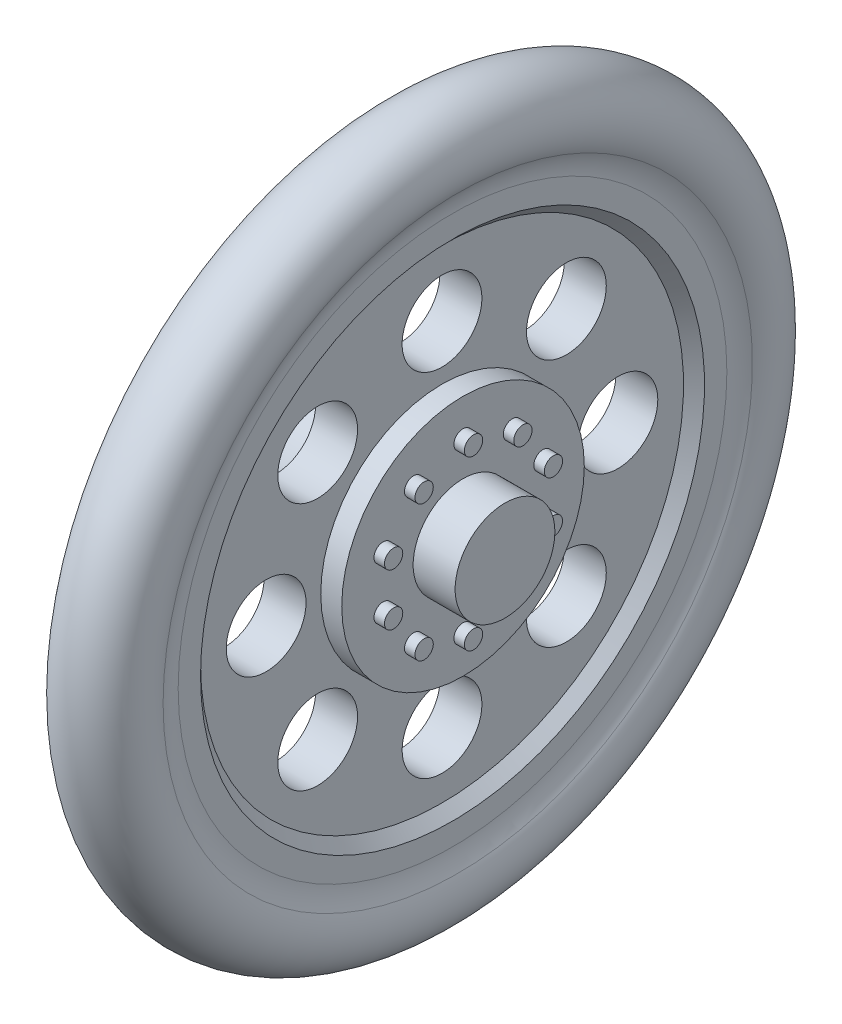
ISO-10303-21;
HEADER;
FILE_DESCRIPTION(('STEP AP214'),'2;1');
FILE_NAME('part.step','',(''),(''),'','','');
FILE_SCHEMA(('AUTOMOTIVE_DESIGN { 1 0 10303 214 1 1 1 1 }'));
ENDSEC;
DATA;
#1=APPLICATION_CONTEXT('core data for automotive mechanical design processes');
#2=APPLICATION_PROTOCOL_DEFINITION('international standard','automotive_design',2000,#1);
#3=PRODUCT_CONTEXT('',#1,'mechanical');
#4=PRODUCT('Part','Part','',(#3));
#5=PRODUCT_RELATED_PRODUCT_CATEGORY('part','',(#4));
#6=PRODUCT_DEFINITION_FORMATION('','',#4);
#7=PRODUCT_DEFINITION_CONTEXT('part definition',#1,'design');
#8=PRODUCT_DEFINITION('design','',#6,#7);
#9=PRODUCT_DEFINITION_SHAPE('','',#8);
#10=(LENGTH_UNIT() NAMED_UNIT(*) SI_UNIT(.MILLI.,.METRE.));
#11=(NAMED_UNIT(*) PLANE_ANGLE_UNIT() SI_UNIT($,.RADIAN.));
#12=(NAMED_UNIT(*) SI_UNIT($,.STERADIAN.) SOLID_ANGLE_UNIT());
#13=UNCERTAINTY_MEASURE_WITH_UNIT(LENGTH_MEASURE(1.E-05),#10,'distance_accuracy_value','');
#14=(GEOMETRIC_REPRESENTATION_CONTEXT(3) GLOBAL_UNCERTAINTY_ASSIGNED_CONTEXT((#13)) GLOBAL_UNIT_ASSIGNED_CONTEXT((#10,
#11,#12)) REPRESENTATION_CONTEXT('',''));
#15=CARTESIAN_POINT('',(0.,0.,0.));
#16=DIRECTION('',(0.,0.,1.));
#17=DIRECTION('',(1.,0.,0.));
#18=AXIS2_PLACEMENT_3D('',#15,#16,#17);
#19=CARTESIAN_POINT('',(10.5,0.,0.));
#20=DIRECTION('',(1.,0.,0.));
#21=DIRECTION('',(0.,0.,-1.));
#22=AXIS2_PLACEMENT_3D('',#19,#20,#21);
#23=PLANE('',#22);
#24=CARTESIAN_POINT('',(10.5,1.23606797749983,-3.8042260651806));
#25=DIRECTION('',(1.,0.,0.));
#26=DIRECTION('',(0.,-0.95105651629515,-0.309016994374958));
#27=AXIS2_PLACEMENT_3D('',#24,#25,#26);
#28=CIRCLE('',#27,0.435);
#29=CARTESIAN_POINT('',(10.5,0.822358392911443,-3.93864845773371));
#30=VERTEX_POINT('',#29);
#31=EDGE_CURVE('E102',#30,#30,#28,.T.);
#32=ORIENTED_EDGE('',*,*,#31,.F.);
#33=EDGE_LOOP('',(#32));
#34=FACE_BOUND('',#33,.T.);
#35=CARTESIAN_POINT('',(10.5,-3.23606797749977,-2.35114100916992));
#36=DIRECTION('',(1.,0.,0.));
#37=DIRECTION('',(0.,-0.58778525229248,0.809016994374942));
#38=AXIS2_PLACEMENT_3D('',#35,#36,#37);
#39=CIRCLE('',#38,0.435);
#40=CARTESIAN_POINT('',(10.5,-3.491754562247,-1.99921861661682));
#41=VERTEX_POINT('',#40);
#42=EDGE_CURVE('E114',#41,#41,#39,.T.);
#43=ORIENTED_EDGE('',*,*,#42,.F.);
#44=EDGE_LOOP('',(#43));
#45=FACE_BOUND('',#44,.T.);
#46=CARTESIAN_POINT('',(10.5,-3.2360679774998,2.35114100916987));
#47=DIRECTION('',(1.,0.,0.));
#48=DIRECTION('',(0.,0.587785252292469,0.809016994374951));
#49=AXIS2_PLACEMENT_3D('',#46,#47,#48);
#50=CIRCLE('',#49,0.435);
#51=CARTESIAN_POINT('',(10.5,-2.98038139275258,2.70306340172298));
#52=VERTEX_POINT('',#51);
#53=EDGE_CURVE('E126',#52,#52,#50,.T.);
#54=ORIENTED_EDGE('',*,*,#53,.F.);
#55=EDGE_LOOP('',(#54));
#56=FACE_BOUND('',#55,.T.);
#57=CARTESIAN_POINT('',(10.5,1.23606797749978,3.80422606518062));
#58=DIRECTION('',(1.,0.,0.));
#59=DIRECTION('',(0.,0.951056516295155,-0.309016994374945));
#60=AXIS2_PLACEMENT_3D('',#57,#58,#59);
#61=CIRCLE('',#60,0.435);
#62=CARTESIAN_POINT('',(10.5,1.64977756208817,3.66980367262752));
#63=VERTEX_POINT('',#62);
#64=EDGE_CURVE('E138',#63,#63,#61,.T.);
#65=ORIENTED_EDGE('',*,*,#64,.F.);
#66=EDGE_LOOP('',(#65));
#67=FACE_BOUND('',#66,.T.);
#68=CARTESIAN_POINT('',(10.5,4.,0.));
#69=DIRECTION('',(1.,0.,0.));
#70=DIRECTION('',(0.,0.,-1.));
#71=AXIS2_PLACEMENT_3D('',#68,#69,#70);
#72=CIRCLE('',#71,0.435);
#73=CARTESIAN_POINT('',(10.5,4.,-0.435));
#74=VERTEX_POINT('',#73);
#75=EDGE_CURVE('E150',#74,#74,#72,.T.);
#76=ORIENTED_EDGE('',*,*,#75,.F.);
#77=EDGE_LOOP('',(#76));
#78=FACE_BOUND('',#77,.T.);
#79=CARTESIAN_POINT('',(10.5,0.,0.));
#80=DIRECTION('',(1.,0.,0.));
#81=DIRECTION('',(0.,0.,-1.));
#82=AXIS2_PLACEMENT_3D('',#79,#80,#81);
#83=CIRCLE('',#82,5.775);
#84=CARTESIAN_POINT('',(10.5,0.,-5.775));
#85=VERTEX_POINT('',#84);
#86=EDGE_CURVE('E162',#85,#85,#83,.T.);
#87=ORIENTED_EDGE('',*,*,#86,.T.);
#88=EDGE_LOOP('',(#87));
#89=FACE_BOUND('',#88,.T.);
#90=CARTESIAN_POINT('',(10.5,0.,0.));
#91=DIRECTION('',(1.,0.,0.));
#92=DIRECTION('',(0.,0.,-1.));
#93=AXIS2_PLACEMENT_3D('',#90,#91,#92);
#94=CIRCLE('',#93,2.375);
#95=CARTESIAN_POINT('',(10.5,0.,-2.375));
#96=VERTEX_POINT('',#95);
#97=EDGE_CURVE('E156',#96,#96,#94,.T.);
#98=ORIENTED_EDGE('',*,*,#97,.F.);
#99=EDGE_LOOP('',(#98));
#100=FACE_BOUND('',#99,.T.);
#101=CARTESIAN_POINT('',(10.5,3.23606797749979,2.3511410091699));
#102=DIRECTION('',(1.,0.,0.));
#103=DIRECTION('',(0.,0.587785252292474,-0.809016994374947));
#104=AXIS2_PLACEMENT_3D('',#101,#102,#103);
#105=CIRCLE('',#104,0.435);
#106=CARTESIAN_POINT('',(10.5,3.49175456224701,1.9992186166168));
#107=VERTEX_POINT('',#106);
#108=EDGE_CURVE('E144',#107,#107,#105,.T.);
#109=ORIENTED_EDGE('',*,*,#108,.F.);
#110=EDGE_LOOP('',(#109));
#111=FACE_BOUND('',#110,.T.);
#112=CARTESIAN_POINT('',(10.5,-1.23606797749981,3.80422606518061));
#113=DIRECTION('',(1.,0.,0.));
#114=DIRECTION('',(0.,0.951056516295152,0.309016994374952));
#115=AXIS2_PLACEMENT_3D('',#112,#113,#114);
#116=CIRCLE('',#115,0.435);
#117=CARTESIAN_POINT('',(10.5,-0.822358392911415,3.93864845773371));
#118=VERTEX_POINT('',#117);
#119=EDGE_CURVE('E132',#118,#118,#116,.T.);
#120=ORIENTED_EDGE('',*,*,#119,.F.);
#121=EDGE_LOOP('',(#120));
#122=FACE_BOUND('',#121,.T.);
#123=CARTESIAN_POINT('',(10.5,-4.,0.));
#124=DIRECTION('',(1.,0.,0.));
#125=DIRECTION('',(0.,0.,1.));
#126=AXIS2_PLACEMENT_3D('',#123,#124,#125);
#127=CIRCLE('',#126,0.435);
#128=CARTESIAN_POINT('',(10.5,-4.,0.434999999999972));
#129=VERTEX_POINT('',#128);
#130=EDGE_CURVE('E120',#129,#129,#127,.T.);
#131=ORIENTED_EDGE('',*,*,#130,.F.);
#132=EDGE_LOOP('',(#131));
#133=FACE_BOUND('',#132,.T.);
#134=CARTESIAN_POINT('',(10.5,-1.23606797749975,-3.80422606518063));
#135=DIRECTION('',(1.,0.,0.));
#136=DIRECTION('',(0.,-0.951056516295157,0.309016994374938));
#137=AXIS2_PLACEMENT_3D('',#134,#135,#136);
#138=CIRCLE('',#137,0.435);
#139=CARTESIAN_POINT('',(10.5,-1.64977756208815,-3.66980367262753));
#140=VERTEX_POINT('',#139);
#141=EDGE_CURVE('E108',#140,#140,#138,.T.);
#142=ORIENTED_EDGE('',*,*,#141,.F.);
#143=EDGE_LOOP('',(#142));
#144=FACE_BOUND('',#143,.T.);
#145=CARTESIAN_POINT('',(10.5,3.23606797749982,-2.35114100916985));
#146=DIRECTION('',(1.,0.,0.));
#147=DIRECTION('',(0.,-0.587785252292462,-0.809016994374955));
#148=AXIS2_PLACEMENT_3D('',#145,#146,#147);
#149=CIRCLE('',#148,0.435);
#150=CARTESIAN_POINT('',(10.5,2.9803813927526,-2.70306340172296));
#151=VERTEX_POINT('',#150);
#152=EDGE_CURVE('E52',#151,#151,#149,.T.);
#153=ORIENTED_EDGE('',*,*,#152,.F.);
#154=EDGE_LOOP('',(#153));
#155=FACE_BOUND('',#154,.T.);
#156=ADVANCED_FACE('F32',(#34,#45,#56,#67,#78,#89,#100,#111,#122,#133,#144,#155),#23,.T.);
#157=CARTESIAN_POINT('',(9.5,11.5,0.));
#158=DIRECTION('',(-1.,0.,0.));
#159=DIRECTION('',(0.,0.,1.));
#160=AXIS2_PLACEMENT_3D('',#157,#158,#159);
#161=PLANE('',#160);
#162=CARTESIAN_POINT('',(9.5,5.92201929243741,-5.92201929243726));
#163=DIRECTION('',(1.,0.,0.));
#164=DIRECTION('',(0.,-0.707106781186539,-0.707106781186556));
#165=AXIS2_PLACEMENT_3D('',#162,#163,#164);
#166=CIRCLE('',#165,1.9);
#167=CARTESIAN_POINT('',(9.5,4.57851640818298,-7.26552217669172));
#168=VERTEX_POINT('',#167);
#169=EDGE_CURVE('E85',#168,#168,#166,.T.);
#170=ORIENTED_EDGE('',*,*,#169,.F.);
#171=EDGE_LOOP('',(#170));
#172=FACE_BOUND('',#171,.T.);
#173=CARTESIAN_POINT('',(9.5,0.,-8.375));
#174=DIRECTION('',(1.,0.,0.));
#175=DIRECTION('',(0.,-1.,0.));
#176=AXIS2_PLACEMENT_3D('',#173,#174,#175);
#177=CIRCLE('',#176,1.9);
#178=CARTESIAN_POINT('',(9.5,-1.89999999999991,-8.37500000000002));
#179=VERTEX_POINT('',#178);
#180=EDGE_CURVE('E75',#179,#179,#177,.T.);
#181=ORIENTED_EDGE('',*,*,#180,.F.);
#182=EDGE_LOOP('',(#181));
#183=FACE_BOUND('',#182,.T.);
#184=CARTESIAN_POINT('',(9.5,-5.92201929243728,-5.92201929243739));
#185=DIRECTION('',(1.,0.,0.));
#186=DIRECTION('',(0.,-0.707106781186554,0.707106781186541));
#187=AXIS2_PLACEMENT_3D('',#184,#185,#186);
#188=CIRCLE('',#187,1.9);
#189=CARTESIAN_POINT('',(9.5,-7.26552217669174,-4.57851640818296));
#190=VERTEX_POINT('',#189);
#191=EDGE_CURVE('E72',#190,#190,#188,.T.);
#192=ORIENTED_EDGE('',*,*,#191,.F.);
#193=EDGE_LOOP('',(#192));
#194=FACE_BOUND('',#193,.T.);
#195=CARTESIAN_POINT('',(9.5,-8.375,0.));
#196=DIRECTION('',(1.,0.,0.));
#197=DIRECTION('',(0.,0.,1.));
#198=AXIS2_PLACEMENT_3D('',#195,#196,#197);
#199=CIRCLE('',#198,1.9);
#200=CARTESIAN_POINT('',(9.5,-8.37500000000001,1.89999999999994));
#201=VERTEX_POINT('',#200);
#202=EDGE_CURVE('E69',#201,#201,#199,.T.);
#203=ORIENTED_EDGE('',*,*,#202,.F.);
#204=EDGE_LOOP('',(#203));
#205=FACE_BOUND('',#204,.T.);
#206=CARTESIAN_POINT('',(9.5,-5.92201929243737,5.92201929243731));
#207=DIRECTION('',(1.,0.,0.));
#208=DIRECTION('',(0.,0.707106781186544,0.707106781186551));
#209=AXIS2_PLACEMENT_3D('',#206,#207,#208);
#210=CIRCLE('',#209,1.9);
#211=CARTESIAN_POINT('',(9.5,-4.57851640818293,7.26552217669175));
#212=VERTEX_POINT('',#211);
#213=EDGE_CURVE('E65',#212,#212,#210,.T.);
#214=ORIENTED_EDGE('',*,*,#213,.F.);
#215=EDGE_LOOP('',(#214));
#216=FACE_BOUND('',#215,.T.);
#217=CARTESIAN_POINT('',(9.5,0.,8.375));
#218=DIRECTION('',(1.,0.,0.));
#219=DIRECTION('',(0.,1.,0.));
#220=AXIS2_PLACEMENT_3D('',#217,#218,#219);
#221=CIRCLE('',#220,1.9);
#222=CARTESIAN_POINT('',(9.5,1.89999999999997,8.37500000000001));
#223=VERTEX_POINT('',#222);
#224=EDGE_CURVE('E61',#223,#223,#221,.T.);
#225=ORIENTED_EDGE('',*,*,#224,.F.);
#226=EDGE_LOOP('',(#225));
#227=FACE_BOUND('',#226,.T.);
#228=CARTESIAN_POINT('',(9.5,5.92201929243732,5.92201929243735));
#229=DIRECTION('',(1.,0.,0.));
#230=DIRECTION('',(0.,0.707106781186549,-0.707106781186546));
#231=AXIS2_PLACEMENT_3D('',#228,#229,#230);
#232=CIRCLE('',#231,1.9);
#233=CARTESIAN_POINT('',(9.5,7.26552217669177,4.57851640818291));
#234=VERTEX_POINT('',#233);
#235=EDGE_CURVE('E57',#234,#234,#232,.T.);
#236=ORIENTED_EDGE('',*,*,#235,.F.);
#237=EDGE_LOOP('',(#236));
#238=FACE_BOUND('',#237,.T.);
#239=CARTESIAN_POINT('',(9.5,8.375,0.));
#240=DIRECTION('',(1.,0.,0.));
#241=DIRECTION('',(0.,0.,-1.));
#242=AXIS2_PLACEMENT_3D('',#239,#240,#241);
#243=CIRCLE('',#242,1.9);
#244=CARTESIAN_POINT('',(9.5,8.375,-1.9));
#245=VERTEX_POINT('',#244);
#246=EDGE_CURVE('E53',#245,#245,#243,.T.);
#247=ORIENTED_EDGE('',*,*,#246,.F.);
#248=EDGE_LOOP('',(#247));
#249=FACE_BOUND('',#248,.T.);
#250=CARTESIAN_POINT('',(9.5,0.,0.));
#251=DIRECTION('',(-1.,0.,0.));
#252=DIRECTION('',(0.,0.,1.));
#253=AXIS2_PLACEMENT_3D('',#250,#251,#252);
#254=CIRCLE('',#253,11.5);
#255=CARTESIAN_POINT('',(9.5,0.,11.5));
#256=VERTEX_POINT('',#255);
#257=EDGE_CURVE('E182',#256,#256,#254,.T.);
#258=ORIENTED_EDGE('',*,*,#257,.F.);
#259=EDGE_LOOP('',(#258));
#260=FACE_BOUND('',#259,.T.);
#261=CARTESIAN_POINT('',(9.5,0.,0.));
#262=DIRECTION('',(-1.,0.,0.));
#263=DIRECTION('',(0.,0.,1.));
#264=AXIS2_PLACEMENT_3D('',#261,#262,#263);
#265=CIRCLE('',#264,5.775);
#266=CARTESIAN_POINT('',(9.5,0.,5.775));
#267=VERTEX_POINT('',#266);
#268=EDGE_CURVE('E11',#267,#267,#265,.F.);
#269=ORIENTED_EDGE('',*,*,#268,.F.);
#270=EDGE_LOOP('',(#269));
#271=FACE_BOUND('',#270,.T.);
#272=ADVANCED_FACE('F220',(#172,#183,#194,#205,#216,#227,#238,#249,#260,#271),#161,.F.);
#273=CARTESIAN_POINT('',(0.,0.,0.));
#274=DIRECTION('',(1.,0.,0.));
#275=DIRECTION('',(0.,0.,-1.));
#276=AXIS2_PLACEMENT_3D('',#273,#274,#275);
#277=PLANE('',#276);
#278=CARTESIAN_POINT('',(0.,0.,0.));
#279=DIRECTION('',(-1.,0.,0.));
#280=DIRECTION('',(0.,0.,1.));
#281=AXIS2_PLACEMENT_3D('',#278,#279,#280);
#282=CIRCLE('',#281,1.63);
#283=CARTESIAN_POINT('',(0.,0.,1.63));
#284=VERTEX_POINT('',#283);
#285=EDGE_CURVE('E638',#284,#284,#282,.T.);
#286=ORIENTED_EDGE('',*,*,#285,.F.);
#287=EDGE_LOOP('',(#286));
#288=FACE_BOUND('',#287,.T.);
#289=CARTESIAN_POINT('',(0.,0.,0.));
#290=DIRECTION('',(-1.,0.,0.));
#291=DIRECTION('',(0.,0.,1.));
#292=AXIS2_PLACEMENT_3D('',#289,#290,#291);
#293=CIRCLE('',#292,3.1);
#294=CARTESIAN_POINT('',(0.,0.,3.1));
#295=VERTEX_POINT('',#294);
#296=EDGE_CURVE('E167',#295,#295,#293,.T.);
#297=ORIENTED_EDGE('',*,*,#296,.T.);
#298=EDGE_LOOP('',(#297));
#299=FACE_BOUND('',#298,.T.);
#300=ADVANCED_FACE('F226',(#288,#299),#277,.F.);
#301=CARTESIAN_POINT('',(9.5,0.,0.));
#302=DIRECTION('',(1.,0.,0.));
#303=DIRECTION('',(0.,0.,-1.));
#304=AXIS2_PLACEMENT_3D('',#301,#302,#303);
#305=CONICAL_SURFACE('',#304,11.5,0.785398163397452);
#306=CARTESIAN_POINT('',(10.,0.,0.));
#307=DIRECTION('',(-1.,0.,0.));
#308=DIRECTION('',(0.,0.,1.));
#309=AXIS2_PLACEMENT_3D('',#306,#307,#308);
#310=CIRCLE('',#309,12.);
#311=CARTESIAN_POINT('',(10.,0.,12.));
#312=VERTEX_POINT('',#311);
#313=EDGE_CURVE('E179',#312,#312,#310,.T.);
#314=ORIENTED_EDGE('',*,*,#313,.F.);
#315=EDGE_LOOP('',(#314));
#316=FACE_BOUND('',#315,.T.);
#317=ORIENTED_EDGE('',*,*,#257,.T.);
#318=EDGE_LOOP('',(#317));
#319=FACE_BOUND('',#318,.T.);
#320=ADVANCED_FACE('F250',(#316,#319),#305,.F.);
#321=CARTESIAN_POINT('',(10.,13.6771243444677,0.));
#322=DIRECTION('',(-1.,0.,0.));
#323=DIRECTION('',(0.,0.,1.));
#324=AXIS2_PLACEMENT_3D('',#321,#322,#323);
#325=PLANE('',#324);
#326=CARTESIAN_POINT('',(10.,0.,0.));
#327=DIRECTION('',(-1.,0.,0.));
#328=DIRECTION('',(0.,0.,1.));
#329=AXIS2_PLACEMENT_3D('',#326,#327,#328);
#330=CIRCLE('',#329,13.0635083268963);
#331=CARTESIAN_POINT('',(10.,0.,13.0635083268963));
#332=VERTEX_POINT('',#331);
#333=EDGE_CURVE('E40',#332,#332,#330,.F.);
#334=ORIENTED_EDGE('',*,*,#333,.T.);
#335=EDGE_LOOP('',(#334));
#336=FACE_BOUND('',#335,.T.);
#337=ORIENTED_EDGE('',*,*,#313,.T.);
#338=EDGE_LOOP('',(#337));
#339=FACE_BOUND('',#338,.T.);
#340=ADVANCED_FACE('F256',(#336,#339),#325,.F.);
#341=CARTESIAN_POINT('',(8.5,0.,0.));
#342=DIRECTION('',(-1.,0.,0.));
#343=DIRECTION('',(0.,0.,1.));
#344=AXIS2_PLACEMENT_3D('',#341,#342,#343);
#345=TOROIDAL_SURFACE('',#344,15.,2.);
#346=CARTESIAN_POINT('',(6.74999999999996,0.,0.));
#347=DIRECTION('',(1.,0.,0.));
#348=DIRECTION('',(0.,0.,-1.));
#349=AXIS2_PLACEMENT_3D('',#346,#347,#348);
#350=CIRCLE('',#349,14.0317541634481);
#351=CARTESIAN_POINT('',(6.74999999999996,0.,-14.0317541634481));
#352=VERTEX_POINT('',#351);
#353=EDGE_CURVE('E45',#352,#352,#350,.T.);
#354=ORIENTED_EDGE('',*,*,#353,.T.);
#355=EDGE_LOOP('',(#354));
#356=FACE_BOUND('',#355,.T.);
#357=CARTESIAN_POINT('',(10.25,0.,0.));
#358=DIRECTION('',(-1.,0.,0.));
#359=DIRECTION('',(0.,0.,1.));
#360=AXIS2_PLACEMENT_3D('',#357,#358,#359);
#361=CIRCLE('',#360,14.0317541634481);
#362=CARTESIAN_POINT('',(10.25,0.,14.0317541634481));
#363=VERTEX_POINT('',#362);
#364=EDGE_CURVE('E188',#363,#363,#361,.T.);
#365=ORIENTED_EDGE('',*,*,#364,.T.);
#366=EDGE_LOOP('',(#365));
#367=FACE_BOUND('',#366,.T.);
#368=ADVANCED_FACE('F193',(#356,#367),#345,.T.);
#369=CARTESIAN_POINT('',(7.,13.6771243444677,0.));
#370=DIRECTION('',(1.,0.,0.));
#371=DIRECTION('',(0.,0.,-1.));
#372=AXIS2_PLACEMENT_3D('',#369,#370,#371);
#373=PLANE('',#372);
#374=CARTESIAN_POINT('',(7.,0.,0.));
#375=DIRECTION('',(1.,0.,0.));
#376=DIRECTION('',(0.,0.,-1.));
#377=AXIS2_PLACEMENT_3D('',#374,#375,#376);
#378=CIRCLE('',#377,13.0635083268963);
#379=CARTESIAN_POINT('',(7.,0.,-13.0635083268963));
#380=VERTEX_POINT('',#379);
#381=EDGE_CURVE('E185',#380,#380,#378,.F.);
#382=ORIENTED_EDGE('',*,*,#381,.T.);
#383=EDGE_LOOP('',(#382));
#384=FACE_BOUND('',#383,.T.);
#385=CARTESIAN_POINT('',(7.,0.,0.));
#386=DIRECTION('',(-1.,0.,0.));
#387=DIRECTION('',(0.,0.,1.));
#388=AXIS2_PLACEMENT_3D('',#385,#386,#387);
#389=CIRCLE('',#388,12.);
#390=CARTESIAN_POINT('',(7.,0.,12.));
#391=VERTEX_POINT('',#390);
#392=EDGE_CURVE('E176',#391,#391,#389,.T.);
#393=ORIENTED_EDGE('',*,*,#392,.F.);
#394=EDGE_LOOP('',(#393));
#395=FACE_BOUND('',#394,.T.);
#396=ADVANCED_FACE('F202',(#384,#395),#373,.F.);
#397=CARTESIAN_POINT('',(7.,0.,0.));
#398=DIRECTION('',(-1.,0.,0.));
#399=DIRECTION('',(0.,0.,1.));
#400=AXIS2_PLACEMENT_3D('',#397,#398,#399);
#401=CONICAL_SURFACE('',#400,12.,0.785398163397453);
#402=CARTESIAN_POINT('',(7.5,0.,0.));
#403=DIRECTION('',(-1.,0.,0.));
#404=DIRECTION('',(0.,0.,1.));
#405=AXIS2_PLACEMENT_3D('',#402,#403,#404);
#406=CIRCLE('',#405,11.5);
#407=CARTESIAN_POINT('',(7.5,0.,11.5));
#408=VERTEX_POINT('',#407);
#409=EDGE_CURVE('E173',#408,#408,#406,.T.);
#410=ORIENTED_EDGE('',*,*,#409,.F.);
#411=EDGE_LOOP('',(#410));
#412=FACE_BOUND('',#411,.T.);
#413=ORIENTED_EDGE('',*,*,#392,.T.);
#414=EDGE_LOOP('',(#413));
#415=FACE_BOUND('',#414,.T.);
#416=ADVANCED_FACE('F205',(#412,#415),#401,.F.);
#417=CARTESIAN_POINT('',(7.5,3.1,0.));
#418=DIRECTION('',(1.,0.,0.));
#419=DIRECTION('',(0.,0.,-1.));
#420=AXIS2_PLACEMENT_3D('',#417,#418,#419);
#421=PLANE('',#420);
#422=CARTESIAN_POINT('',(7.5,5.92201929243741,-5.92201929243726));
#423=DIRECTION('',(1.,0.,0.));
#424=DIRECTION('',(0.,0.,-1.));
#425=AXIS2_PLACEMENT_3D('',#422,#423,#424);
#426=CIRCLE('',#425,1.9);
#427=CARTESIAN_POINT('',(7.5,5.92201929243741,-7.82201929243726));
#428=VERTEX_POINT('',#427);
#429=EDGE_CURVE('E36',#428,#428,#426,.T.);
#430=ORIENTED_EDGE('',*,*,#429,.T.);
#431=EDGE_LOOP('',(#430));
#432=FACE_BOUND('',#431,.T.);
#433=CARTESIAN_POINT('',(7.5,0.,-8.375));
#434=DIRECTION('',(1.,0.,0.));
#435=DIRECTION('',(0.,0.,-1.));
#436=AXIS2_PLACEMENT_3D('',#433,#434,#435);
#437=CIRCLE('',#436,1.9);
#438=CARTESIAN_POINT('',(7.5,0.,-10.275));
#439=VERTEX_POINT('',#438);
#440=EDGE_CURVE('E73',#439,#439,#437,.T.);
#441=ORIENTED_EDGE('',*,*,#440,.T.);
#442=EDGE_LOOP('',(#441));
#443=FACE_BOUND('',#442,.T.);
#444=CARTESIAN_POINT('',(7.5,-5.92201929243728,-5.92201929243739));
#445=DIRECTION('',(1.,0.,0.));
#446=DIRECTION('',(0.,0.,-1.));
#447=AXIS2_PLACEMENT_3D('',#444,#445,#446);
#448=CIRCLE('',#447,1.9);
#449=CARTESIAN_POINT('',(7.5,-5.92201929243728,-7.82201929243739));
#450=VERTEX_POINT('',#449);
#451=EDGE_CURVE('E70',#450,#450,#448,.T.);
#452=ORIENTED_EDGE('',*,*,#451,.T.);
#453=EDGE_LOOP('',(#452));
#454=FACE_BOUND('',#453,.T.);
#455=CARTESIAN_POINT('',(7.5,-8.375,0.));
#456=DIRECTION('',(1.,0.,0.));
#457=DIRECTION('',(0.,0.,-1.));
#458=AXIS2_PLACEMENT_3D('',#455,#456,#457);
#459=CIRCLE('',#458,1.9);
#460=CARTESIAN_POINT('',(7.5,-8.375,-1.90000000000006));
#461=VERTEX_POINT('',#460);
#462=EDGE_CURVE('E66',#461,#461,#459,.T.);
#463=ORIENTED_EDGE('',*,*,#462,.T.);
#464=EDGE_LOOP('',(#463));
#465=FACE_BOUND('',#464,.T.);
#466=CARTESIAN_POINT('',(7.5,-5.92201929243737,5.92201929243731));
#467=DIRECTION('',(1.,0.,0.));
#468=DIRECTION('',(0.,0.,-1.));
#469=AXIS2_PLACEMENT_3D('',#466,#467,#468);
#470=CIRCLE('',#469,1.9);
#471=CARTESIAN_POINT('',(7.5,-5.92201929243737,4.0220192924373));
#472=VERTEX_POINT('',#471);
#473=EDGE_CURVE('E62',#472,#472,#470,.T.);
#474=ORIENTED_EDGE('',*,*,#473,.T.);
#475=EDGE_LOOP('',(#474));
#476=FACE_BOUND('',#475,.T.);
#477=CARTESIAN_POINT('',(7.5,0.,8.375));
#478=DIRECTION('',(1.,0.,0.));
#479=DIRECTION('',(0.,0.,-1.));
#480=AXIS2_PLACEMENT_3D('',#477,#478,#479);
#481=CIRCLE('',#480,1.9);
#482=CARTESIAN_POINT('',(7.5,0.,6.475));
#483=VERTEX_POINT('',#482);
#484=EDGE_CURVE('E58',#483,#483,#481,.T.);
#485=ORIENTED_EDGE('',*,*,#484,.T.);
#486=EDGE_LOOP('',(#485));
#487=FACE_BOUND('',#486,.T.);
#488=CARTESIAN_POINT('',(7.5,5.92201929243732,5.92201929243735));
#489=DIRECTION('',(1.,0.,0.));
#490=DIRECTION('',(0.,0.,-1.));
#491=AXIS2_PLACEMENT_3D('',#488,#489,#490);
#492=CIRCLE('',#491,1.9);
#493=CARTESIAN_POINT('',(7.5,5.92201929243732,4.02201929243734));
#494=VERTEX_POINT('',#493);
#495=EDGE_CURVE('E54',#494,#494,#492,.T.);
#496=ORIENTED_EDGE('',*,*,#495,.T.);
#497=EDGE_LOOP('',(#496));
#498=FACE_BOUND('',#497,.T.);
#499=CARTESIAN_POINT('',(7.5,8.375,0.));
#500=DIRECTION('',(1.,0.,0.));
#501=DIRECTION('',(0.,0.,-1.));
#502=AXIS2_PLACEMENT_3D('',#499,#500,#501);
#503=CIRCLE('',#502,1.9);
#504=CARTESIAN_POINT('',(7.5,8.375,-1.9));
#505=VERTEX_POINT('',#504);
#506=EDGE_CURVE('E49',#505,#505,#503,.T.);
#507=ORIENTED_EDGE('',*,*,#506,.T.);
#508=EDGE_LOOP('',(#507));
#509=FACE_BOUND('',#508,.T.);
#510=CARTESIAN_POINT('',(7.5,0.,0.));
#511=DIRECTION('',(-1.,0.,0.));
#512=DIRECTION('',(0.,0.,1.));
#513=AXIS2_PLACEMENT_3D('',#510,#511,#512);
#514=CIRCLE('',#513,3.1);
#515=CARTESIAN_POINT('',(7.5,0.,3.1));
#516=VERTEX_POINT('',#515);
#517=EDGE_CURVE('E170',#516,#516,#514,.T.);
#518=ORIENTED_EDGE('',*,*,#517,.F.);
#519=EDGE_LOOP('',(#518));
#520=FACE_BOUND('',#519,.T.);
#521=ORIENTED_EDGE('',*,*,#409,.T.);
#522=EDGE_LOOP('',(#521));
#523=FACE_BOUND('',#522,.T.);
#524=ADVANCED_FACE('F210',(#432,#443,#454,#465,#476,#487,#498,#509,#520,#523),#421,.F.);
#525=CARTESIAN_POINT('',(0.,0.,0.));
#526=DIRECTION('',(-1.,0.,0.));
#527=DIRECTION('',(0.,0.,1.));
#528=AXIS2_PLACEMENT_3D('',#525,#526,#527);
#529=CYLINDRICAL_SURFACE('',#528,3.1);
#530=ORIENTED_EDGE('',*,*,#296,.F.);
#531=EDGE_LOOP('',(#530));
#532=FACE_BOUND('',#531,.T.);
#533=ORIENTED_EDGE('',*,*,#517,.T.);
#534=EDGE_LOOP('',(#533));
#535=FACE_BOUND('',#534,.T.);
#536=ADVANCED_FACE('F199',(#532,#535),#529,.T.);
#537=CARTESIAN_POINT('',(5.,0.,0.));
#538=DIRECTION('',(-1.,0.,0.));
#539=DIRECTION('',(0.,0.,1.));
#540=AXIS2_PLACEMENT_3D('',#537,#538,#539);
#541=TOROIDAL_SURFACE('',#540,13.0635083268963,2.);
#542=ORIENTED_EDGE('',*,*,#353,.F.);
#543=EDGE_LOOP('',(#542));
#544=FACE_BOUND('',#543,.T.);
#545=ORIENTED_EDGE('',*,*,#381,.F.);
#546=EDGE_LOOP('',(#545));
#547=FACE_BOUND('',#546,.T.);
#548=ADVANCED_FACE('F196',(#544,#547),#541,.F.);
#549=CARTESIAN_POINT('',(12.,0.,0.));
#550=DIRECTION('',(1.,0.,0.));
#551=DIRECTION('',(0.,0.,-1.));
#552=AXIS2_PLACEMENT_3D('',#549,#550,#551);
#553=TOROIDAL_SURFACE('',#552,13.0635083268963,2.);
#554=ORIENTED_EDGE('',*,*,#333,.F.);
#555=EDGE_LOOP('',(#554));
#556=FACE_BOUND('',#555,.T.);
#557=ORIENTED_EDGE('',*,*,#364,.F.);
#558=EDGE_LOOP('',(#557));
#559=FACE_BOUND('',#558,.T.);
#560=ADVANCED_FACE('F34',(#556,#559),#553,.F.);
#561=CARTESIAN_POINT('',(10.5,0.,0.));
#562=DIRECTION('',(-1.,0.,0.));
#563=DIRECTION('',(0.,0.,1.));
#564=AXIS2_PLACEMENT_3D('',#561,#562,#563);
#565=CYLINDRICAL_SURFACE('',#564,5.775);
#566=ORIENTED_EDGE('',*,*,#86,.F.);
#567=EDGE_LOOP('',(#566));
#568=FACE_BOUND('',#567,.T.);
#569=ORIENTED_EDGE('',*,*,#268,.T.);
#570=EDGE_LOOP('',(#569));
#571=FACE_BOUND('',#570,.T.);
#572=ADVANCED_FACE('F235',(#568,#571),#565,.T.);
#573=CARTESIAN_POINT('',(12.5,0.,0.));
#574=DIRECTION('',(-1.,0.,0.));
#575=DIRECTION('',(0.,0.,1.));
#576=AXIS2_PLACEMENT_3D('',#573,#574,#575);
#577=CYLINDRICAL_SURFACE('',#576,2.375);
#578=CARTESIAN_POINT('',(12.5,0.,0.));
#579=DIRECTION('',(1.,0.,0.));
#580=DIRECTION('',(0.,0.,-1.));
#581=AXIS2_PLACEMENT_3D('',#578,#579,#580);
#582=CIRCLE('',#581,2.375);
#583=CARTESIAN_POINT('',(12.5,0.,-2.375));
#584=VERTEX_POINT('',#583);
#585=EDGE_CURVE('E159',#584,#584,#582,.T.);
#586=ORIENTED_EDGE('',*,*,#585,.F.);
#587=EDGE_LOOP('',(#586));
#588=FACE_BOUND('',#587,.T.);
#589=ORIENTED_EDGE('',*,*,#97,.T.);
#590=EDGE_LOOP('',(#589));
#591=FACE_BOUND('',#590,.T.);
#592=ADVANCED_FACE('F233',(#588,#591),#577,.T.);
#593=CARTESIAN_POINT('',(12.5,0.,0.));
#594=DIRECTION('',(1.,0.,0.));
#595=DIRECTION('',(0.,0.,-1.));
#596=AXIS2_PLACEMENT_3D('',#593,#594,#595);
#597=PLANE('',#596);
#598=ORIENTED_EDGE('',*,*,#585,.T.);
#599=EDGE_LOOP('',(#598));
#600=FACE_BOUND('',#599,.T.);
#601=ADVANCED_FACE('F305',(#600),#597,.T.);
#602=CARTESIAN_POINT('',(11.,4.,0.));
#603=DIRECTION('',(-1.,0.,0.));
#604=DIRECTION('',(0.,0.,1.));
#605=AXIS2_PLACEMENT_3D('',#602,#603,#604);
#606=CYLINDRICAL_SURFACE('',#605,0.435);
#607=CARTESIAN_POINT('',(11.,4.,0.));
#608=DIRECTION('',(1.,0.,0.));
#609=DIRECTION('',(0.,0.,-1.));
#610=AXIS2_PLACEMENT_3D('',#607,#608,#609);
#611=CIRCLE('',#610,0.435);
#612=CARTESIAN_POINT('',(11.,4.,-0.435));
#613=VERTEX_POINT('',#612);
#614=EDGE_CURVE('E153',#613,#613,#611,.T.);
#615=ORIENTED_EDGE('',*,*,#614,.F.);
#616=EDGE_LOOP('',(#615));
#617=FACE_BOUND('',#616,.T.);
#618=ORIENTED_EDGE('',*,*,#75,.T.);
#619=EDGE_LOOP('',(#618));
#620=FACE_BOUND('',#619,.T.);
#621=ADVANCED_FACE('F314',(#617,#620),#606,.T.);
#622=CARTESIAN_POINT('',(11.,4.,0.));
#623=DIRECTION('',(1.,0.,0.));
#624=DIRECTION('',(0.,0.,-1.));
#625=AXIS2_PLACEMENT_3D('',#622,#623,#624);
#626=PLANE('',#625);
#627=ORIENTED_EDGE('',*,*,#614,.T.);
#628=EDGE_LOOP('',(#627));
#629=FACE_BOUND('',#628,.T.);
#630=ADVANCED_FACE('F323',(#629),#626,.T.);
#631=CARTESIAN_POINT('',(11.,3.23606797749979,2.3511410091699));
#632=DIRECTION('',(-1.,0.,0.));
#633=DIRECTION('',(0.,0.,1.));
#634=AXIS2_PLACEMENT_3D('',#631,#632,#633);
#635=CYLINDRICAL_SURFACE('',#634,0.435);
#636=CARTESIAN_POINT('',(11.,3.23606797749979,2.3511410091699));
#637=DIRECTION('',(1.,0.,0.));
#638=DIRECTION('',(0.,0.587785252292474,-0.809016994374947));
#639=AXIS2_PLACEMENT_3D('',#636,#637,#638);
#640=CIRCLE('',#639,0.435);
#641=CARTESIAN_POINT('',(11.,3.49175456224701,1.9992186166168));
#642=VERTEX_POINT('',#641);
#643=EDGE_CURVE('E147',#642,#642,#640,.T.);
#644=ORIENTED_EDGE('',*,*,#643,.F.);
#645=EDGE_LOOP('',(#644));
#646=FACE_BOUND('',#645,.T.);
#647=ORIENTED_EDGE('',*,*,#108,.T.);
#648=EDGE_LOOP('',(#647));
#649=FACE_BOUND('',#648,.T.);
#650=ADVANCED_FACE('F332',(#646,#649),#635,.T.);
#651=CARTESIAN_POINT('',(11.,3.23606797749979,2.3511410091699));
#652=DIRECTION('',(1.,0.,0.));
#653=DIRECTION('',(0.,0.587785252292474,-0.809016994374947));
#654=AXIS2_PLACEMENT_3D('',#651,#652,#653);
#655=PLANE('',#654);
#656=ORIENTED_EDGE('',*,*,#643,.T.);
#657=EDGE_LOOP('',(#656));
#658=FACE_BOUND('',#657,.T.);
#659=ADVANCED_FACE('F347',(#658),#655,.T.);
#660=CARTESIAN_POINT('',(11.,1.23606797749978,3.80422606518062));
#661=DIRECTION('',(-1.,0.,0.));
#662=DIRECTION('',(0.,0.,1.));
#663=AXIS2_PLACEMENT_3D('',#660,#661,#662);
#664=CYLINDRICAL_SURFACE('',#663,0.435);
#665=CARTESIAN_POINT('',(11.,1.23606797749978,3.80422606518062));
#666=DIRECTION('',(1.,0.,0.));
#667=DIRECTION('',(0.,0.951056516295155,-0.309016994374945));
#668=AXIS2_PLACEMENT_3D('',#665,#666,#667);
#669=CIRCLE('',#668,0.435);
#670=CARTESIAN_POINT('',(11.,1.64977756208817,3.66980367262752));
#671=VERTEX_POINT('',#670);
#672=EDGE_CURVE('E141',#671,#671,#669,.T.);
#673=ORIENTED_EDGE('',*,*,#672,.F.);
#674=EDGE_LOOP('',(#673));
#675=FACE_BOUND('',#674,.T.);
#676=ORIENTED_EDGE('',*,*,#64,.T.);
#677=EDGE_LOOP('',(#676));
#678=FACE_BOUND('',#677,.T.);
#679=ADVANCED_FACE('F357',(#675,#678),#664,.T.);
#680=CARTESIAN_POINT('',(11.,1.23606797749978,3.80422606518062));
#681=DIRECTION('',(1.,0.,0.));
#682=DIRECTION('',(0.,0.951056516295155,-0.309016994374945));
#683=AXIS2_PLACEMENT_3D('',#680,#681,#682);
#684=PLANE('',#683);
#685=ORIENTED_EDGE('',*,*,#672,.T.);
#686=EDGE_LOOP('',(#685));
#687=FACE_BOUND('',#686,.T.);
#688=ADVANCED_FACE('F367',(#687),#684,.T.);
#689=CARTESIAN_POINT('',(11.,-1.23606797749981,3.80422606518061));
#690=DIRECTION('',(-1.,0.,0.));
#691=DIRECTION('',(0.,0.,1.));
#692=AXIS2_PLACEMENT_3D('',#689,#690,#691);
#693=CYLINDRICAL_SURFACE('',#692,0.435);
#694=CARTESIAN_POINT('',(11.,-1.23606797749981,3.80422606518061));
#695=DIRECTION('',(1.,0.,0.));
#696=DIRECTION('',(0.,0.951056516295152,0.309016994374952));
#697=AXIS2_PLACEMENT_3D('',#694,#695,#696);
#698=CIRCLE('',#697,0.435);
#699=CARTESIAN_POINT('',(11.,-0.822358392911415,3.93864845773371));
#700=VERTEX_POINT('',#699);
#701=EDGE_CURVE('E135',#700,#700,#698,.T.);
#702=ORIENTED_EDGE('',*,*,#701,.F.);
#703=EDGE_LOOP('',(#702));
#704=FACE_BOUND('',#703,.T.);
#705=ORIENTED_EDGE('',*,*,#119,.T.);
#706=EDGE_LOOP('',(#705));
#707=FACE_BOUND('',#706,.T.);
#708=ADVANCED_FACE('F377',(#704,#707),#693,.T.);
#709=CARTESIAN_POINT('',(11.,-1.23606797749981,3.80422606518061));
#710=DIRECTION('',(1.,0.,0.));
#711=DIRECTION('',(0.,0.951056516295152,0.309016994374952));
#712=AXIS2_PLACEMENT_3D('',#709,#710,#711);
#713=PLANE('',#712);
#714=ORIENTED_EDGE('',*,*,#701,.T.);
#715=EDGE_LOOP('',(#714));
#716=FACE_BOUND('',#715,.T.);
#717=ADVANCED_FACE('F387',(#716),#713,.T.);
#718=CARTESIAN_POINT('',(11.,-3.2360679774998,2.35114100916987));
#719=DIRECTION('',(-1.,0.,0.));
#720=DIRECTION('',(0.,0.,1.));
#721=AXIS2_PLACEMENT_3D('',#718,#719,#720);
#722=CYLINDRICAL_SURFACE('',#721,0.435);
#723=CARTESIAN_POINT('',(11.,-3.2360679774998,2.35114100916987));
#724=DIRECTION('',(1.,0.,0.));
#725=DIRECTION('',(0.,0.587785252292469,0.809016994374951));
#726=AXIS2_PLACEMENT_3D('',#723,#724,#725);
#727=CIRCLE('',#726,0.435);
#728=CARTESIAN_POINT('',(11.,-2.98038139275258,2.70306340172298));
#729=VERTEX_POINT('',#728);
#730=EDGE_CURVE('E129',#729,#729,#727,.T.);
#731=ORIENTED_EDGE('',*,*,#730,.F.);
#732=EDGE_LOOP('',(#731));
#733=FACE_BOUND('',#732,.T.);
#734=ORIENTED_EDGE('',*,*,#53,.T.);
#735=EDGE_LOOP('',(#734));
#736=FACE_BOUND('',#735,.T.);
#737=ADVANCED_FACE('F397',(#733,#736),#722,.T.);
#738=CARTESIAN_POINT('',(11.,-3.2360679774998,2.35114100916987));
#739=DIRECTION('',(1.,0.,0.));
#740=DIRECTION('',(0.,0.587785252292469,0.809016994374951));
#741=AXIS2_PLACEMENT_3D('',#738,#739,#740);
#742=PLANE('',#741);
#743=ORIENTED_EDGE('',*,*,#730,.T.);
#744=EDGE_LOOP('',(#743));
#745=FACE_BOUND('',#744,.T.);
#746=ADVANCED_FACE('F407',(#745),#742,.T.);
#747=CARTESIAN_POINT('',(11.,-4.,0.));
#748=DIRECTION('',(-1.,0.,0.));
#749=DIRECTION('',(0.,0.,1.));
#750=AXIS2_PLACEMENT_3D('',#747,#748,#749);
#751=CYLINDRICAL_SURFACE('',#750,0.435);
#752=CARTESIAN_POINT('',(11.,-4.,0.));
#753=DIRECTION('',(1.,0.,0.));
#754=DIRECTION('',(0.,0.,1.));
#755=AXIS2_PLACEMENT_3D('',#752,#753,#754);
#756=CIRCLE('',#755,0.435);
#757=CARTESIAN_POINT('',(11.,-4.,0.434999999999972));
#758=VERTEX_POINT('',#757);
#759=EDGE_CURVE('E123',#758,#758,#756,.T.);
#760=ORIENTED_EDGE('',*,*,#759,.F.);
#761=EDGE_LOOP('',(#760));
#762=FACE_BOUND('',#761,.T.);
#763=ORIENTED_EDGE('',*,*,#130,.T.);
#764=EDGE_LOOP('',(#763));
#765=FACE_BOUND('',#764,.T.);
#766=ADVANCED_FACE('F417',(#762,#765),#751,.T.);
#767=CARTESIAN_POINT('',(11.,-4.,0.));
#768=DIRECTION('',(1.,0.,0.));
#769=DIRECTION('',(0.,0.,1.));
#770=AXIS2_PLACEMENT_3D('',#767,#768,#769);
#771=PLANE('',#770);
#772=ORIENTED_EDGE('',*,*,#759,.T.);
#773=EDGE_LOOP('',(#772));
#774=FACE_BOUND('',#773,.T.);
#775=ADVANCED_FACE('F427',(#774),#771,.T.);
#776=CARTESIAN_POINT('',(11.,-3.23606797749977,-2.35114100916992));
#777=DIRECTION('',(-1.,0.,0.));
#778=DIRECTION('',(0.,0.,1.));
#779=AXIS2_PLACEMENT_3D('',#776,#777,#778);
#780=CYLINDRICAL_SURFACE('',#779,0.435);
#781=CARTESIAN_POINT('',(11.,-3.23606797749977,-2.35114100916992));
#782=DIRECTION('',(1.,0.,0.));
#783=DIRECTION('',(0.,-0.58778525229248,0.809016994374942));
#784=AXIS2_PLACEMENT_3D('',#781,#782,#783);
#785=CIRCLE('',#784,0.435);
#786=CARTESIAN_POINT('',(11.,-3.491754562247,-1.99921861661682));
#787=VERTEX_POINT('',#786);
#788=EDGE_CURVE('E117',#787,#787,#785,.T.);
#789=ORIENTED_EDGE('',*,*,#788,.F.);
#790=EDGE_LOOP('',(#789));
#791=FACE_BOUND('',#790,.T.);
#792=ORIENTED_EDGE('',*,*,#42,.T.);
#793=EDGE_LOOP('',(#792));
#794=FACE_BOUND('',#793,.T.);
#795=ADVANCED_FACE('F437',(#791,#794),#780,.T.);
#796=CARTESIAN_POINT('',(11.,-3.23606797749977,-2.35114100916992));
#797=DIRECTION('',(1.,0.,0.));
#798=DIRECTION('',(0.,-0.58778525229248,0.809016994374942));
#799=AXIS2_PLACEMENT_3D('',#796,#797,#798);
#800=PLANE('',#799);
#801=ORIENTED_EDGE('',*,*,#788,.T.);
#802=EDGE_LOOP('',(#801));
#803=FACE_BOUND('',#802,.T.);
#804=ADVANCED_FACE('F447',(#803),#800,.T.);
#805=CARTESIAN_POINT('',(11.,-1.23606797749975,-3.80422606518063));
#806=DIRECTION('',(-1.,0.,0.));
#807=DIRECTION('',(0.,0.,1.));
#808=AXIS2_PLACEMENT_3D('',#805,#806,#807);
#809=CYLINDRICAL_SURFACE('',#808,0.435);
#810=CARTESIAN_POINT('',(11.,-1.23606797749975,-3.80422606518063));
#811=DIRECTION('',(1.,0.,0.));
#812=DIRECTION('',(0.,-0.951056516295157,0.309016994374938));
#813=AXIS2_PLACEMENT_3D('',#810,#811,#812);
#814=CIRCLE('',#813,0.435);
#815=CARTESIAN_POINT('',(11.,-1.64977756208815,-3.66980367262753));
#816=VERTEX_POINT('',#815);
#817=EDGE_CURVE('E111',#816,#816,#814,.T.);
#818=ORIENTED_EDGE('',*,*,#817,.F.);
#819=EDGE_LOOP('',(#818));
#820=FACE_BOUND('',#819,.T.);
#821=ORIENTED_EDGE('',*,*,#141,.T.);
#822=EDGE_LOOP('',(#821));
#823=FACE_BOUND('',#822,.T.);
#824=ADVANCED_FACE('F457',(#820,#823),#809,.T.);
#825=CARTESIAN_POINT('',(11.,-1.23606797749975,-3.80422606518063));
#826=DIRECTION('',(1.,0.,0.));
#827=DIRECTION('',(0.,-0.951056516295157,0.309016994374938));
#828=AXIS2_PLACEMENT_3D('',#825,#826,#827);
#829=PLANE('',#828);
#830=ORIENTED_EDGE('',*,*,#817,.T.);
#831=EDGE_LOOP('',(#830));
#832=FACE_BOUND('',#831,.T.);
#833=ADVANCED_FACE('F467',(#832),#829,.T.);
#834=CARTESIAN_POINT('',(11.,1.23606797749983,-3.8042260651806));
#835=DIRECTION('',(-1.,0.,0.));
#836=DIRECTION('',(0.,0.,1.));
#837=AXIS2_PLACEMENT_3D('',#834,#835,#836);
#838=CYLINDRICAL_SURFACE('',#837,0.435);
#839=CARTESIAN_POINT('',(11.,1.23606797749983,-3.8042260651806));
#840=DIRECTION('',(1.,0.,0.));
#841=DIRECTION('',(0.,-0.95105651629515,-0.309016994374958));
#842=AXIS2_PLACEMENT_3D('',#839,#840,#841);
#843=CIRCLE('',#842,0.435);
#844=CARTESIAN_POINT('',(11.,0.822358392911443,-3.93864845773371));
#845=VERTEX_POINT('',#844);
#846=EDGE_CURVE('E105',#845,#845,#843,.T.);
#847=ORIENTED_EDGE('',*,*,#846,.F.);
#848=EDGE_LOOP('',(#847));
#849=FACE_BOUND('',#848,.T.);
#850=ORIENTED_EDGE('',*,*,#31,.T.);
#851=EDGE_LOOP('',(#850));
#852=FACE_BOUND('',#851,.T.);
#853=ADVANCED_FACE('F477',(#849,#852),#838,.T.);
#854=CARTESIAN_POINT('',(11.,1.23606797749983,-3.8042260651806));
#855=DIRECTION('',(1.,0.,0.));
#856=DIRECTION('',(0.,-0.95105651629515,-0.309016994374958));
#857=AXIS2_PLACEMENT_3D('',#854,#855,#856);
#858=PLANE('',#857);
#859=ORIENTED_EDGE('',*,*,#846,.T.);
#860=EDGE_LOOP('',(#859));
#861=FACE_BOUND('',#860,.T.);
#862=ADVANCED_FACE('F487',(#861),#858,.T.);
#863=CARTESIAN_POINT('',(11.,3.23606797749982,-2.35114100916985));
#864=DIRECTION('',(-1.,0.,0.));
#865=DIRECTION('',(0.,0.,1.));
#866=AXIS2_PLACEMENT_3D('',#863,#864,#865);
#867=CYLINDRICAL_SURFACE('',#866,0.435);
#868=CARTESIAN_POINT('',(11.,3.23606797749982,-2.35114100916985));
#869=DIRECTION('',(1.,0.,0.));
#870=DIRECTION('',(0.,-0.587785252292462,-0.809016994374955));
#871=AXIS2_PLACEMENT_3D('',#868,#869,#870);
#872=CIRCLE('',#871,0.435);
#873=CARTESIAN_POINT('',(11.,2.9803813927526,-2.70306340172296));
#874=VERTEX_POINT('',#873);
#875=EDGE_CURVE('E99',#874,#874,#872,.T.);
#876=ORIENTED_EDGE('',*,*,#875,.F.);
#877=EDGE_LOOP('',(#876));
#878=FACE_BOUND('',#877,.T.);
#879=ORIENTED_EDGE('',*,*,#152,.T.);
#880=EDGE_LOOP('',(#879));
#881=FACE_BOUND('',#880,.T.);
#882=ADVANCED_FACE('F497',(#878,#881),#867,.T.);
#883=CARTESIAN_POINT('',(11.,3.23606797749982,-2.35114100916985));
#884=DIRECTION('',(1.,0.,0.));
#885=DIRECTION('',(0.,-0.587785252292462,-0.809016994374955));
#886=AXIS2_PLACEMENT_3D('',#883,#884,#885);
#887=PLANE('',#886);
#888=ORIENTED_EDGE('',*,*,#875,.T.);
#889=EDGE_LOOP('',(#888));
#890=FACE_BOUND('',#889,.T.);
#891=ADVANCED_FACE('F507',(#890),#887,.T.);
#892=CARTESIAN_POINT('',(0.,8.375,0.));
#893=DIRECTION('',(1.,0.,0.));
#894=DIRECTION('',(0.,0.,-1.));
#895=AXIS2_PLACEMENT_3D('',#892,#893,#894);
#896=CYLINDRICAL_SURFACE('',#895,1.9);
#897=ORIENTED_EDGE('',*,*,#246,.T.);
#898=EDGE_LOOP('',(#897));
#899=FACE_BOUND('',#898,.T.);
#900=ORIENTED_EDGE('',*,*,#506,.F.);
#901=EDGE_LOOP('',(#900));
#902=FACE_BOUND('',#901,.T.);
#903=ADVANCED_FACE('F517',(#899,#902),#896,.F.);
#904=CARTESIAN_POINT('',(0.,5.92201929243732,5.92201929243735));
#905=DIRECTION('',(1.,0.,0.));
#906=DIRECTION('',(0.,0.,-1.));
#907=AXIS2_PLACEMENT_3D('',#904,#905,#906);
#908=CYLINDRICAL_SURFACE('',#907,1.9);
#909=ORIENTED_EDGE('',*,*,#235,.T.);
#910=EDGE_LOOP('',(#909));
#911=FACE_BOUND('',#910,.T.);
#912=ORIENTED_EDGE('',*,*,#495,.F.);
#913=EDGE_LOOP('',(#912));
#914=FACE_BOUND('',#913,.T.);
#915=ADVANCED_FACE('F527',(#911,#914),#908,.F.);
#916=CARTESIAN_POINT('',(0.,0.,8.375));
#917=DIRECTION('',(1.,0.,0.));
#918=DIRECTION('',(0.,0.,-1.));
#919=AXIS2_PLACEMENT_3D('',#916,#917,#918);
#920=CYLINDRICAL_SURFACE('',#919,1.9);
#921=ORIENTED_EDGE('',*,*,#224,.T.);
#922=EDGE_LOOP('',(#921));
#923=FACE_BOUND('',#922,.T.);
#924=ORIENTED_EDGE('',*,*,#484,.F.);
#925=EDGE_LOOP('',(#924));
#926=FACE_BOUND('',#925,.T.);
#927=ADVANCED_FACE('F548',(#923,#926),#920,.F.);
#928=CARTESIAN_POINT('',(0.,-5.92201929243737,5.92201929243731));
#929=DIRECTION('',(1.,0.,0.));
#930=DIRECTION('',(0.,0.,-1.));
#931=AXIS2_PLACEMENT_3D('',#928,#929,#930);
#932=CYLINDRICAL_SURFACE('',#931,1.9);
#933=ORIENTED_EDGE('',*,*,#213,.T.);
#934=EDGE_LOOP('',(#933));
#935=FACE_BOUND('',#934,.T.);
#936=ORIENTED_EDGE('',*,*,#473,.F.);
#937=EDGE_LOOP('',(#936));
#938=FACE_BOUND('',#937,.T.);
#939=ADVANCED_FACE('F558',(#935,#938),#932,.F.);
#940=CARTESIAN_POINT('',(0.,-8.375,0.));
#941=DIRECTION('',(1.,0.,0.));
#942=DIRECTION('',(0.,0.,-1.));
#943=AXIS2_PLACEMENT_3D('',#940,#941,#942);
#944=CYLINDRICAL_SURFACE('',#943,1.9);
#945=ORIENTED_EDGE('',*,*,#202,.T.);
#946=EDGE_LOOP('',(#945));
#947=FACE_BOUND('',#946,.T.);
#948=ORIENTED_EDGE('',*,*,#462,.F.);
#949=EDGE_LOOP('',(#948));
#950=FACE_BOUND('',#949,.T.);
#951=ADVANCED_FACE('F568',(#947,#950),#944,.F.);
#952=CARTESIAN_POINT('',(0.,-5.92201929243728,-5.92201929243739));
#953=DIRECTION('',(1.,0.,0.));
#954=DIRECTION('',(0.,0.,-1.));
#955=AXIS2_PLACEMENT_3D('',#952,#953,#954);
#956=CYLINDRICAL_SURFACE('',#955,1.9);
#957=ORIENTED_EDGE('',*,*,#191,.T.);
#958=EDGE_LOOP('',(#957));
#959=FACE_BOUND('',#958,.T.);
#960=ORIENTED_EDGE('',*,*,#451,.F.);
#961=EDGE_LOOP('',(#960));
#962=FACE_BOUND('',#961,.T.);
#963=ADVANCED_FACE('F578',(#959,#962),#956,.F.);
#964=CARTESIAN_POINT('',(0.,0.,-8.375));
#965=DIRECTION('',(1.,0.,0.));
#966=DIRECTION('',(0.,0.,-1.));
#967=AXIS2_PLACEMENT_3D('',#964,#965,#966);
#968=CYLINDRICAL_SURFACE('',#967,1.9);
#969=ORIENTED_EDGE('',*,*,#180,.T.);
#970=EDGE_LOOP('',(#969));
#971=FACE_BOUND('',#970,.T.);
#972=ORIENTED_EDGE('',*,*,#440,.F.);
#973=EDGE_LOOP('',(#972));
#974=FACE_BOUND('',#973,.T.);
#975=ADVANCED_FACE('F588',(#971,#974),#968,.F.);
#976=CARTESIAN_POINT('',(0.,5.92201929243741,-5.92201929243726));
#977=DIRECTION('',(1.,0.,0.));
#978=DIRECTION('',(0.,0.,-1.));
#979=AXIS2_PLACEMENT_3D('',#976,#977,#978);
#980=CYLINDRICAL_SURFACE('',#979,1.9);
#981=ORIENTED_EDGE('',*,*,#169,.T.);
#982=EDGE_LOOP('',(#981));
#983=FACE_BOUND('',#982,.T.);
#984=ORIENTED_EDGE('',*,*,#429,.F.);
#985=EDGE_LOOP('',(#984));
#986=FACE_BOUND('',#985,.T.);
#987=ADVANCED_FACE('F598',(#983,#986),#980,.F.);
#988=CARTESIAN_POINT('',(10.9125,0.,0.));
#989=DIRECTION('',(1.,0.,0.));
#990=DIRECTION('',(0.,0.,-1.));
#991=AXIS2_PLACEMENT_3D('',#988,#989,#990);
#992=PLANE('',#991);
#993=CARTESIAN_POINT('',(10.9125,0.,0.));
#994=DIRECTION('',(1.,0.,0.));
#995=DIRECTION('',(0.,0.,-1.));
#996=AXIS2_PLACEMENT_3D('',#993,#994,#995);
#997=CIRCLE('',#996,1.63);
#998=CARTESIAN_POINT('',(10.9125,0.,-1.63));
#999=VERTEX_POINT('',#998);
#1000=EDGE_CURVE('E641',#999,#999,#997,.F.);
#1001=ORIENTED_EDGE('',*,*,#1000,.T.);
#1002=EDGE_LOOP('',(#1001));
#1003=FACE_BOUND('',#1002,.T.);
#1004=ADVANCED_FACE('F606',(#1003),#992,.F.);
#1005=CARTESIAN_POINT('',(17.1103362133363,0.,0.));
#1006=DIRECTION('',(-1.,0.,0.));
#1007=DIRECTION('',(0.,0.,1.));
#1008=AXIS2_PLACEMENT_3D('',#1005,#1006,#1007);
#1009=CYLINDRICAL_SURFACE('',#1008,1.63);
#1010=ORIENTED_EDGE('',*,*,#285,.T.);
#1011=EDGE_LOOP('',(#1010));
#1012=FACE_BOUND('',#1011,.T.);
#1013=ORIENTED_EDGE('',*,*,#1000,.F.);
#1014=EDGE_LOOP('',(#1013));
#1015=FACE_BOUND('',#1014,.T.);
#1016=ADVANCED_FACE('F622',(#1012,#1015),#1009,.F.);
#1017=CLOSED_SHELL('',(#156,#272,#300,#320,#340,#368,#396,#416,#524,#536,#548,#560,#572,#592,
#601,#621,#630,#650,#659,#679,#688,#708,#717,#737,#746,#766,#775,#795,#804,#824,#833,#853,#862,
#882,#891,#903,#915,#927,#939,#951,#963,#975,#987,#1004,#1016));
#1018=MANIFOLD_SOLID_BREP('B2',#1017);
#1019=ADVANCED_BREP_SHAPE_REPRESENTATION('',(#18,#1018),#14);
#1020=SHAPE_DEFINITION_REPRESENTATION(#9,#1019);
ENDSEC;
END-ISO-10303-21;
